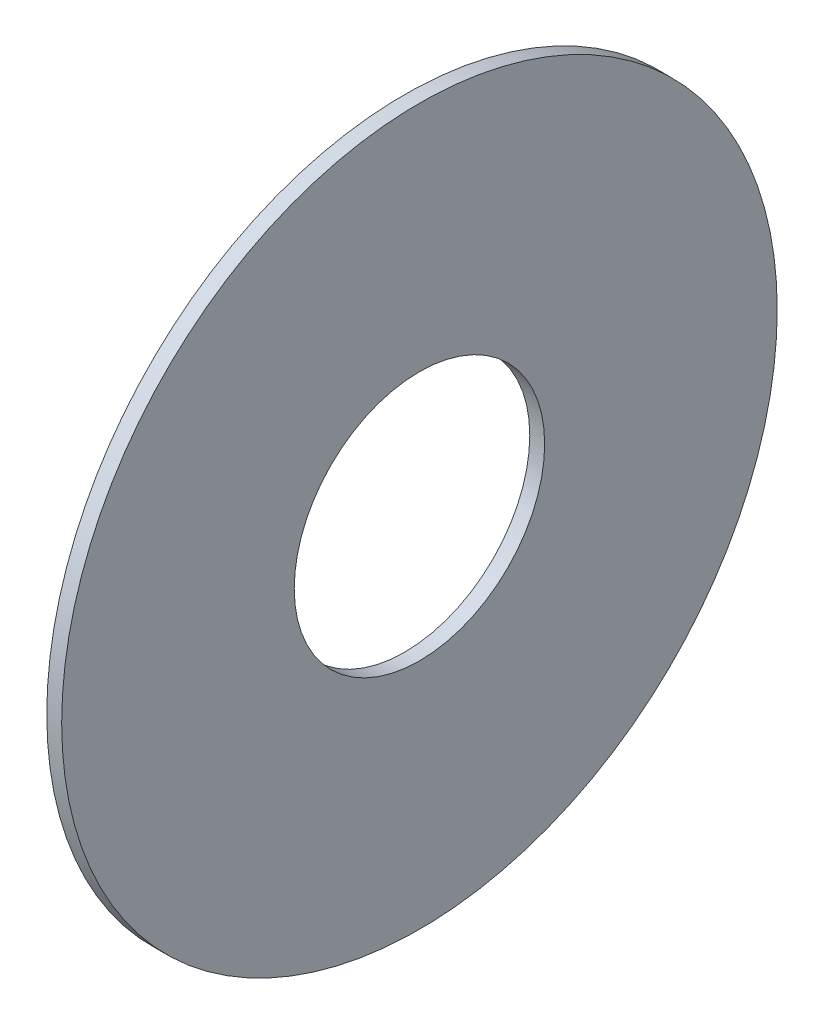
ISO-10303-21;
HEADER;
FILE_DESCRIPTION(('STEP AP214'),'2;1');
FILE_NAME('part.step','',(''),(''),'','','');
FILE_SCHEMA(('AUTOMOTIVE_DESIGN { 1 0 10303 214 1 1 1 1 }'));
ENDSEC;
DATA;
#1=APPLICATION_CONTEXT('core data for automotive mechanical design processes');
#2=APPLICATION_PROTOCOL_DEFINITION('international standard','automotive_design',2000,#1);
#3=PRODUCT_CONTEXT('',#1,'mechanical');
#4=PRODUCT('Part','Part','',(#3));
#5=PRODUCT_RELATED_PRODUCT_CATEGORY('part','',(#4));
#6=PRODUCT_DEFINITION_FORMATION('','',#4);
#7=PRODUCT_DEFINITION_CONTEXT('part definition',#1,'design');
#8=PRODUCT_DEFINITION('design','',#6,#7);
#9=PRODUCT_DEFINITION_SHAPE('','',#8);
#10=(LENGTH_UNIT() NAMED_UNIT(*) SI_UNIT(.MILLI.,.METRE.));
#11=(NAMED_UNIT(*) PLANE_ANGLE_UNIT() SI_UNIT($,.RADIAN.));
#12=(NAMED_UNIT(*) SI_UNIT($,.STERADIAN.) SOLID_ANGLE_UNIT());
#13=UNCERTAINTY_MEASURE_WITH_UNIT(LENGTH_MEASURE(1.E-05),#10,'distance_accuracy_value','');
#14=(GEOMETRIC_REPRESENTATION_CONTEXT(3) GLOBAL_UNCERTAINTY_ASSIGNED_CONTEXT((#13)) GLOBAL_UNIT_ASSIGNED_CONTEXT((#10,
#11,#12)) REPRESENTATION_CONTEXT('',''));
#15=CARTESIAN_POINT('',(0.,0.,0.));
#16=DIRECTION('',(0.,0.,1.));
#17=DIRECTION('',(1.,0.,0.));
#18=AXIS2_PLACEMENT_3D('',#15,#16,#17);
#19=CARTESIAN_POINT('',(-34.9249999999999,0.,0.));
#20=DIRECTION('',(-1.,0.,0.));
#21=DIRECTION('',(0.,0.,1.));
#22=AXIS2_PLACEMENT_3D('',#19,#20,#21);
#23=CYLINDRICAL_SURFACE('',#22,4.2);
#24=CARTESIAN_POINT('',(0.,0.,0.));
#25=DIRECTION('',(-1.,0.,0.));
#26=DIRECTION('',(0.,0.,1.));
#27=AXIS2_PLACEMENT_3D('',#24,#25,#26);
#28=CIRCLE('',#27,4.2);
#29=CARTESIAN_POINT('',(0.,0.,4.2));
#30=VERTEX_POINT('',#29);
#31=EDGE_CURVE('E49',#30,#30,#28,.T.);
#32=ORIENTED_EDGE('',*,*,#31,.F.);
#33=EDGE_LOOP('',(#32));
#34=FACE_BOUND('',#33,.T.);
#35=CARTESIAN_POINT('',(-0.5,0.,0.));
#36=DIRECTION('',(-1.,0.,0.));
#37=DIRECTION('',(0.,0.,1.));
#38=AXIS2_PLACEMENT_3D('',#35,#36,#37);
#39=CIRCLE('',#38,4.2);
#40=CARTESIAN_POINT('',(-0.5,0.,4.2));
#41=VERTEX_POINT('',#40);
#42=EDGE_CURVE('E10',#41,#41,#39,.T.);
#43=ORIENTED_EDGE('',*,*,#42,.T.);
#44=EDGE_LOOP('',(#43));
#45=FACE_BOUND('',#44,.T.);
#46=ADVANCED_FACE('F35',(#34,#45),#23,.F.);
#47=CARTESIAN_POINT('',(-0.5,12.,0.));
#48=DIRECTION('',(1.,0.,0.));
#49=DIRECTION('',(0.,0.,-1.));
#50=AXIS2_PLACEMENT_3D('',#47,#48,#49);
#51=PLANE('',#50);
#52=ORIENTED_EDGE('',*,*,#42,.F.);
#53=EDGE_LOOP('',(#52));
#54=FACE_BOUND('',#53,.T.);
#55=CARTESIAN_POINT('',(-0.5,0.,0.));
#56=DIRECTION('',(-1.,0.,0.));
#57=DIRECTION('',(0.,0.,1.));
#58=AXIS2_PLACEMENT_3D('',#55,#56,#57);
#59=CIRCLE('',#58,12.);
#60=CARTESIAN_POINT('',(-0.5,0.,12.));
#61=VERTEX_POINT('',#60);
#62=EDGE_CURVE('E41',#61,#61,#59,.T.);
#63=ORIENTED_EDGE('',*,*,#62,.T.);
#64=EDGE_LOOP('',(#63));
#65=FACE_BOUND('',#64,.T.);
#66=ADVANCED_FACE('F58',(#54,#65),#51,.F.);
#67=CARTESIAN_POINT('',(-34.9249999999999,0.,0.));
#68=DIRECTION('',(-1.,0.,0.));
#69=DIRECTION('',(0.,0.,1.));
#70=AXIS2_PLACEMENT_3D('',#67,#68,#69);
#71=CYLINDRICAL_SURFACE('',#70,12.);
#72=ORIENTED_EDGE('',*,*,#62,.F.);
#73=EDGE_LOOP('',(#72));
#74=FACE_BOUND('',#73,.T.);
#75=CARTESIAN_POINT('',(0.,0.,0.));
#76=DIRECTION('',(-1.,0.,0.));
#77=DIRECTION('',(0.,0.,1.));
#78=AXIS2_PLACEMENT_3D('',#75,#76,#77);
#79=CIRCLE('',#78,12.);
#80=CARTESIAN_POINT('',(0.,0.,12.));
#81=VERTEX_POINT('',#80);
#82=EDGE_CURVE('E45',#81,#81,#79,.T.);
#83=ORIENTED_EDGE('',*,*,#82,.T.);
#84=EDGE_LOOP('',(#83));
#85=FACE_BOUND('',#84,.T.);
#86=ADVANCED_FACE('F62',(#74,#85),#71,.T.);
#87=CARTESIAN_POINT('',(0.,4.2,0.));
#88=DIRECTION('',(-1.,0.,0.));
#89=DIRECTION('',(0.,0.,1.));
#90=AXIS2_PLACEMENT_3D('',#87,#88,#89);
#91=PLANE('',#90);
#92=ORIENTED_EDGE('',*,*,#82,.F.);
#93=EDGE_LOOP('',(#92));
#94=FACE_BOUND('',#93,.T.);
#95=ORIENTED_EDGE('',*,*,#31,.T.);
#96=EDGE_LOOP('',(#95));
#97=FACE_BOUND('',#96,.T.);
#98=ADVANCED_FACE('F55',(#94,#97),#91,.F.);
#99=CLOSED_SHELL('',(#46,#66,#86,#98));
#100=MANIFOLD_SOLID_BREP('B2',#99);
#101=ADVANCED_BREP_SHAPE_REPRESENTATION('',(#18,#100),#14);
#102=SHAPE_DEFINITION_REPRESENTATION(#9,#101);
ENDSEC;
END-ISO-10303-21;
